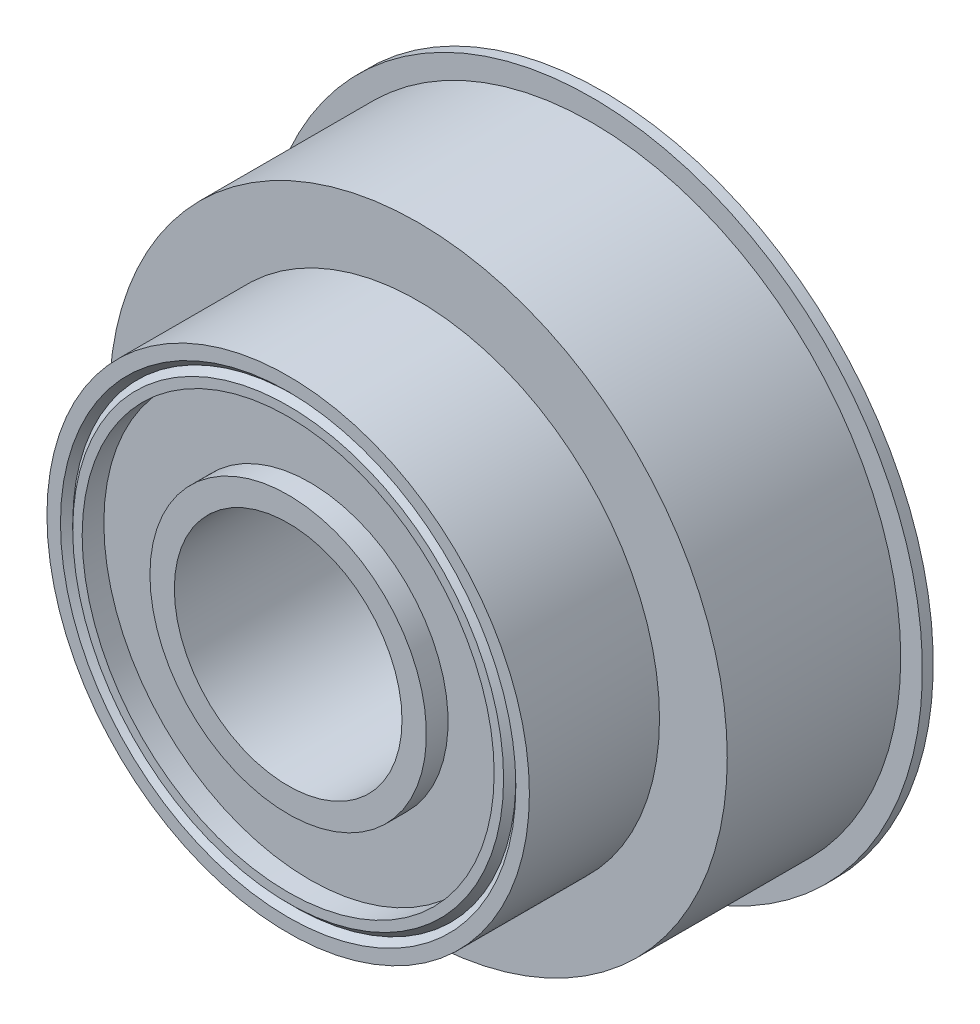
ISO-10303-21;
HEADER;
FILE_DESCRIPTION(('STEP AP214'),'2;1');
FILE_NAME('part.step','',(''),(''),'','','');
FILE_SCHEMA(('AUTOMOTIVE_DESIGN { 1 0 10303 214 1 1 1 1 }'));
ENDSEC;
DATA;
#1=APPLICATION_CONTEXT('core data for automotive mechanical design processes');
#2=APPLICATION_PROTOCOL_DEFINITION('international standard','automotive_design',2000,#1);
#3=PRODUCT_CONTEXT('',#1,'mechanical');
#4=PRODUCT('Part','Part','',(#3));
#5=PRODUCT_RELATED_PRODUCT_CATEGORY('part','',(#4));
#6=PRODUCT_DEFINITION_FORMATION('','',#4);
#7=PRODUCT_DEFINITION_CONTEXT('part definition',#1,'design');
#8=PRODUCT_DEFINITION('design','',#6,#7);
#9=PRODUCT_DEFINITION_SHAPE('','',#8);
#10=(LENGTH_UNIT() NAMED_UNIT(*) SI_UNIT(.MILLI.,.METRE.));
#11=(NAMED_UNIT(*) PLANE_ANGLE_UNIT() SI_UNIT($,.RADIAN.));
#12=(NAMED_UNIT(*) SI_UNIT($,.STERADIAN.) SOLID_ANGLE_UNIT());
#13=UNCERTAINTY_MEASURE_WITH_UNIT(LENGTH_MEASURE(1.E-05),#10,'distance_accuracy_value','');
#14=(GEOMETRIC_REPRESENTATION_CONTEXT(3) GLOBAL_UNCERTAINTY_ASSIGNED_CONTEXT((#13)) GLOBAL_UNIT_ASSIGNED_CONTEXT((#10,
#11,#12)) REPRESENTATION_CONTEXT('',''));
#15=CARTESIAN_POINT('',(0.,0.,0.));
#16=DIRECTION('',(0.,0.,1.));
#17=DIRECTION('',(1.,0.,0.));
#18=AXIS2_PLACEMENT_3D('',#15,#16,#17);
#19=CARTESIAN_POINT('',(0.,0.,-80.9));
#20=DIRECTION('',(0.,0.,-1.));
#21=DIRECTION('',(-1.,0.,0.));
#22=AXIS2_PLACEMENT_3D('',#19,#20,#21);
#23=CYLINDRICAL_SURFACE('',#22,10.5);
#24=CARTESIAN_POINT('',(0.,0.,-19.7706576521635));
#25=DIRECTION('',(0.,0.,-1.));
#26=DIRECTION('',(-1.,0.,0.));
#27=AXIS2_PLACEMENT_3D('',#24,#25,#26);
#28=CIRCLE('',#27,10.5);
#29=CARTESIAN_POINT('',(-10.5,0.,-19.7706576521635));
#30=VERTEX_POINT('',#29);
#31=EDGE_CURVE('E93',#30,#30,#28,.T.);
#32=ORIENTED_EDGE('',*,*,#31,.T.);
#33=EDGE_LOOP('',(#32));
#34=FACE_BOUND('',#33,.T.);
#35=CARTESIAN_POINT('',(0.,0.,0.));
#36=DIRECTION('',(0.,0.,-1.));
#37=DIRECTION('',(-1.,0.,0.));
#38=AXIS2_PLACEMENT_3D('',#35,#36,#37);
#39=CIRCLE('',#38,10.5);
#40=CARTESIAN_POINT('',(-10.5,0.,0.));
#41=VERTEX_POINT('',#40);
#42=EDGE_CURVE('E10',#41,#41,#39,.T.);
#43=ORIENTED_EDGE('',*,*,#42,.F.);
#44=EDGE_LOOP('',(#43));
#45=FACE_BOUND('',#44,.T.);
#46=ADVANCED_FACE('F29',(#34,#45),#23,.F.);
#47=CARTESIAN_POINT('',(0.,10.5,0.));
#48=DIRECTION('',(0.,0.,1.));
#49=DIRECTION('',(1.,0.,0.));
#50=AXIS2_PLACEMENT_3D('',#47,#48,#49);
#51=PLANE('',#50);
#52=ORIENTED_EDGE('',*,*,#42,.T.);
#53=EDGE_LOOP('',(#52));
#54=FACE_BOUND('',#53,.T.);
#55=CARTESIAN_POINT('',(0.,0.,0.));
#56=DIRECTION('',(0.,0.,-1.));
#57=DIRECTION('',(-1.,0.,0.));
#58=AXIS2_PLACEMENT_3D('',#55,#56,#57);
#59=CIRCLE('',#58,12.75);
#60=CARTESIAN_POINT('',(-12.75,0.,0.));
#61=VERTEX_POINT('',#60);
#62=EDGE_CURVE('E35',#61,#61,#59,.T.);
#63=ORIENTED_EDGE('',*,*,#62,.F.);
#64=EDGE_LOOP('',(#63));
#65=FACE_BOUND('',#64,.T.);
#66=ADVANCED_FACE('F111',(#54,#65),#51,.T.);
#67=CARTESIAN_POINT('',(0.,0.,-80.9));
#68=DIRECTION('',(0.,0.,-1.));
#69=DIRECTION('',(-1.,0.,0.));
#70=AXIS2_PLACEMENT_3D('',#67,#68,#69);
#71=CYLINDRICAL_SURFACE('',#70,12.75);
#72=ORIENTED_EDGE('',*,*,#62,.T.);
#73=EDGE_LOOP('',(#72));
#74=FACE_BOUND('',#73,.T.);
#75=CARTESIAN_POINT('',(0.,0.,-2.));
#76=DIRECTION('',(0.,0.,-1.));
#77=DIRECTION('',(-1.,0.,0.));
#78=AXIS2_PLACEMENT_3D('',#75,#76,#77);
#79=CIRCLE('',#78,12.75);
#80=CARTESIAN_POINT('',(-12.75,0.,-2.));
#81=VERTEX_POINT('',#80);
#82=EDGE_CURVE('E39',#81,#81,#79,.T.);
#83=ORIENTED_EDGE('',*,*,#82,.F.);
#84=EDGE_LOOP('',(#83));
#85=FACE_BOUND('',#84,.T.);
#86=ADVANCED_FACE('F115',(#74,#85),#71,.T.);
#87=CARTESIAN_POINT('',(0.,12.75,-2.));
#88=DIRECTION('',(0.,0.,1.));
#89=DIRECTION('',(1.,0.,0.));
#90=AXIS2_PLACEMENT_3D('',#87,#88,#89);
#91=PLANE('',#90);
#92=ORIENTED_EDGE('',*,*,#82,.T.);
#93=EDGE_LOOP('',(#92));
#94=FACE_BOUND('',#93,.T.);
#95=CARTESIAN_POINT('',(0.,0.,-2.));
#96=DIRECTION('',(0.,0.,-1.));
#97=DIRECTION('',(-1.,0.,0.));
#98=AXIS2_PLACEMENT_3D('',#95,#96,#97);
#99=CIRCLE('',#98,19.);
#100=CARTESIAN_POINT('',(-19.,0.,-2.));
#101=VERTEX_POINT('',#100);
#102=EDGE_CURVE('E43',#101,#101,#99,.T.);
#103=ORIENTED_EDGE('',*,*,#102,.F.);
#104=EDGE_LOOP('',(#103));
#105=FACE_BOUND('',#104,.T.);
#106=ADVANCED_FACE('F119',(#94,#105),#91,.T.);
#107=CARTESIAN_POINT('',(0.,0.,-80.9));
#108=DIRECTION('',(0.,0.,-1.));
#109=DIRECTION('',(-1.,0.,0.));
#110=AXIS2_PLACEMENT_3D('',#107,#108,#109);
#111=CYLINDRICAL_SURFACE('',#110,19.);
#112=ORIENTED_EDGE('',*,*,#102,.T.);
#113=EDGE_LOOP('',(#112));
#114=FACE_BOUND('',#113,.T.);
#115=CARTESIAN_POINT('',(0.,0.,0.));
#116=DIRECTION('',(0.,0.,-1.));
#117=DIRECTION('',(-1.,0.,0.));
#118=AXIS2_PLACEMENT_3D('',#115,#116,#117);
#119=CIRCLE('',#118,19.);
#120=CARTESIAN_POINT('',(-19.,0.,0.));
#121=VERTEX_POINT('',#120);
#122=EDGE_CURVE('E48',#121,#121,#119,.T.);
#123=ORIENTED_EDGE('',*,*,#122,.F.);
#124=EDGE_LOOP('',(#123));
#125=FACE_BOUND('',#124,.T.);
#126=ADVANCED_FACE('F125',(#114,#125),#111,.F.);
#127=CARTESIAN_POINT('',(0.,19.,0.));
#128=DIRECTION('',(0.,0.,1.));
#129=DIRECTION('',(1.,0.,0.));
#130=AXIS2_PLACEMENT_3D('',#127,#128,#129);
#131=PLANE('',#130);
#132=ORIENTED_EDGE('',*,*,#122,.T.);
#133=EDGE_LOOP('',(#132));
#134=FACE_BOUND('',#133,.T.);
#135=CARTESIAN_POINT('',(0.,0.,0.));
#136=DIRECTION('',(0.,0.,-1.));
#137=DIRECTION('',(-1.,0.,0.));
#138=AXIS2_PLACEMENT_3D('',#135,#136,#137);
#139=CIRCLE('',#138,19.8699370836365);
#140=CARTESIAN_POINT('',(-19.8699370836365,0.,0.));
#141=VERTEX_POINT('',#140);
#142=EDGE_CURVE('E51',#141,#141,#139,.T.);
#143=ORIENTED_EDGE('',*,*,#142,.F.);
#144=EDGE_LOOP('',(#143));
#145=FACE_BOUND('',#144,.T.);
#146=ADVANCED_FACE('F129',(#134,#145),#131,.T.);
#147=CARTESIAN_POINT('',(0.,0.,-0.56503145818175));
#148=DIRECTION('',(0.,0.,-1.));
#149=DIRECTION('',(-1.,0.,0.));
#150=AXIS2_PLACEMENT_3D('',#147,#148,#149);
#151=CONICAL_SURFACE('',#150,20.4349685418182,0.785398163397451);
#152=ORIENTED_EDGE('',*,*,#142,.T.);
#153=EDGE_LOOP('',(#152));
#154=FACE_BOUND('',#153,.T.);
#155=CARTESIAN_POINT('',(0.,0.,-0.56503145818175));
#156=DIRECTION('',(0.,0.,-1.));
#157=DIRECTION('',(-1.,0.,0.));
#158=AXIS2_PLACEMENT_3D('',#155,#156,#157);
#159=CIRCLE('',#158,20.4349685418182);
#160=CARTESIAN_POINT('',(-20.4349685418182,0.,-0.56503145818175));
#161=VERTEX_POINT('',#160);
#162=EDGE_CURVE('E54',#161,#161,#159,.T.);
#163=ORIENTED_EDGE('',*,*,#162,.F.);
#164=EDGE_LOOP('',(#163));
#165=FACE_BOUND('',#164,.T.);
#166=ADVANCED_FACE('F133',(#154,#165),#151,.T.);
#167=CARTESIAN_POINT('',(0.,0.,0.));
#168=DIRECTION('',(0.,0.,1.));
#169=DIRECTION('',(1.,0.,0.));
#170=AXIS2_PLACEMENT_3D('',#167,#168,#169);
#171=CONICAL_SURFACE('',#170,21.,0.785398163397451);
#172=ORIENTED_EDGE('',*,*,#162,.T.);
#173=EDGE_LOOP('',(#172));
#174=FACE_BOUND('',#173,.T.);
#175=CARTESIAN_POINT('',(0.,0.,0.));
#176=DIRECTION('',(0.,0.,-1.));
#177=DIRECTION('',(-1.,0.,0.));
#178=AXIS2_PLACEMENT_3D('',#175,#176,#177);
#179=CIRCLE('',#178,21.);
#180=CARTESIAN_POINT('',(-21.,0.,0.));
#181=VERTEX_POINT('',#180);
#182=EDGE_CURVE('E57',#181,#181,#179,.T.);
#183=ORIENTED_EDGE('',*,*,#182,.F.);
#184=EDGE_LOOP('',(#183));
#185=FACE_BOUND('',#184,.T.);
#186=ADVANCED_FACE('F137',(#174,#185),#171,.F.);
#187=CARTESIAN_POINT('',(0.,21.,0.));
#188=DIRECTION('',(0.,0.,1.));
#189=DIRECTION('',(1.,0.,0.));
#190=AXIS2_PLACEMENT_3D('',#187,#188,#189);
#191=PLANE('',#190);
#192=ORIENTED_EDGE('',*,*,#182,.T.);
#193=EDGE_LOOP('',(#192));
#194=FACE_BOUND('',#193,.T.);
#195=CARTESIAN_POINT('',(0.,0.,0.));
#196=DIRECTION('',(0.,0.,-1.));
#197=DIRECTION('',(-1.,0.,0.));
#198=AXIS2_PLACEMENT_3D('',#195,#196,#197);
#199=CIRCLE('',#198,22.25);
#200=CARTESIAN_POINT('',(-22.25,0.,0.));
#201=VERTEX_POINT('',#200);
#202=EDGE_CURVE('E60',#201,#201,#199,.T.);
#203=ORIENTED_EDGE('',*,*,#202,.F.);
#204=EDGE_LOOP('',(#203));
#205=FACE_BOUND('',#204,.T.);
#206=ADVANCED_FACE('F141',(#194,#205),#191,.T.);
#207=CARTESIAN_POINT('',(0.,0.,-80.9));
#208=DIRECTION('',(0.,0.,-1.));
#209=DIRECTION('',(-1.,0.,0.));
#210=AXIS2_PLACEMENT_3D('',#207,#208,#209);
#211=CYLINDRICAL_SURFACE('',#210,22.25);
#212=ORIENTED_EDGE('',*,*,#202,.T.);
#213=EDGE_LOOP('',(#212));
#214=FACE_BOUND('',#213,.T.);
#215=CARTESIAN_POINT('',(0.,0.,-12.));
#216=DIRECTION('',(0.,0.,-1.));
#217=DIRECTION('',(-1.,0.,0.));
#218=AXIS2_PLACEMENT_3D('',#215,#216,#217);
#219=CIRCLE('',#218,22.25);
#220=CARTESIAN_POINT('',(-22.25,0.,-12.));
#221=VERTEX_POINT('',#220);
#222=EDGE_CURVE('E63',#221,#221,#219,.T.);
#223=ORIENTED_EDGE('',*,*,#222,.F.);
#224=EDGE_LOOP('',(#223));
#225=FACE_BOUND('',#224,.T.);
#226=ADVANCED_FACE('F145',(#214,#225),#211,.T.);
#227=CARTESIAN_POINT('',(0.,22.25,-12.));
#228=DIRECTION('',(0.,0.,1.));
#229=DIRECTION('',(1.,0.,0.));
#230=AXIS2_PLACEMENT_3D('',#227,#228,#229);
#231=PLANE('',#230);
#232=ORIENTED_EDGE('',*,*,#222,.T.);
#233=EDGE_LOOP('',(#232));
#234=FACE_BOUND('',#233,.T.);
#235=CARTESIAN_POINT('',(0.,0.,-12.));
#236=DIRECTION('',(0.,0.,-1.));
#237=DIRECTION('',(-1.,0.,0.));
#238=AXIS2_PLACEMENT_3D('',#235,#236,#237);
#239=CIRCLE('',#238,28.5);
#240=CARTESIAN_POINT('',(-28.5,0.,-12.));
#241=VERTEX_POINT('',#240);
#242=EDGE_CURVE('E66',#241,#241,#239,.T.);
#243=ORIENTED_EDGE('',*,*,#242,.F.);
#244=EDGE_LOOP('',(#243));
#245=FACE_BOUND('',#244,.T.);
#246=ADVANCED_FACE('F149',(#234,#245),#231,.T.);
#247=CARTESIAN_POINT('',(0.,0.,-80.9));
#248=DIRECTION('',(0.,0.,-1.));
#249=DIRECTION('',(-1.,0.,0.));
#250=AXIS2_PLACEMENT_3D('',#247,#248,#249);
#251=CYLINDRICAL_SURFACE('',#250,28.5);
#252=ORIENTED_EDGE('',*,*,#242,.T.);
#253=EDGE_LOOP('',(#252));
#254=FACE_BOUND('',#253,.T.);
#255=CARTESIAN_POINT('',(0.,0.,-28.));
#256=DIRECTION('',(0.,0.,-1.));
#257=DIRECTION('',(-1.,0.,0.));
#258=AXIS2_PLACEMENT_3D('',#255,#256,#257);
#259=CIRCLE('',#258,28.5);
#260=CARTESIAN_POINT('',(-28.5,0.,-28.));
#261=VERTEX_POINT('',#260);
#262=EDGE_CURVE('E69',#261,#261,#259,.T.);
#263=ORIENTED_EDGE('',*,*,#262,.F.);
#264=EDGE_LOOP('',(#263));
#265=FACE_BOUND('',#264,.T.);
#266=ADVANCED_FACE('F153',(#254,#265),#251,.T.);
#267=CARTESIAN_POINT('',(0.,28.5,-28.));
#268=DIRECTION('',(0.,0.,1.));
#269=DIRECTION('',(1.,0.,0.));
#270=AXIS2_PLACEMENT_3D('',#267,#268,#269);
#271=PLANE('',#270);
#272=ORIENTED_EDGE('',*,*,#262,.T.);
#273=EDGE_LOOP('',(#272));
#274=FACE_BOUND('',#273,.T.);
#275=CARTESIAN_POINT('',(0.,0.,-28.));
#276=DIRECTION('',(0.,0.,-1.));
#277=DIRECTION('',(-1.,0.,0.));
#278=AXIS2_PLACEMENT_3D('',#275,#276,#277);
#279=CIRCLE('',#278,30.5);
#280=CARTESIAN_POINT('',(-30.5,0.,-28.));
#281=VERTEX_POINT('',#280);
#282=EDGE_CURVE('E72',#281,#281,#279,.T.);
#283=ORIENTED_EDGE('',*,*,#282,.F.);
#284=EDGE_LOOP('',(#283));
#285=FACE_BOUND('',#284,.T.);
#286=ADVANCED_FACE('F157',(#274,#285),#271,.T.);
#287=CARTESIAN_POINT('',(0.,0.,-80.9));
#288=DIRECTION('',(0.,0.,-1.));
#289=DIRECTION('',(-1.,0.,0.));
#290=AXIS2_PLACEMENT_3D('',#287,#288,#289);
#291=CYLINDRICAL_SURFACE('',#290,30.5);
#292=ORIENTED_EDGE('',*,*,#282,.T.);
#293=EDGE_LOOP('',(#292));
#294=FACE_BOUND('',#293,.T.);
#295=CARTESIAN_POINT('',(0.,0.,-29.));
#296=DIRECTION('',(0.,0.,-1.));
#297=DIRECTION('',(-1.,0.,0.));
#298=AXIS2_PLACEMENT_3D('',#295,#296,#297);
#299=CIRCLE('',#298,30.5);
#300=CARTESIAN_POINT('',(-30.5,0.,-29.));
#301=VERTEX_POINT('',#300);
#302=EDGE_CURVE('E75',#301,#301,#299,.T.);
#303=ORIENTED_EDGE('',*,*,#302,.F.);
#304=EDGE_LOOP('',(#303));
#305=FACE_BOUND('',#304,.T.);
#306=ADVANCED_FACE('F161',(#294,#305),#291,.T.);
#307=CARTESIAN_POINT('',(0.,30.5,-29.));
#308=DIRECTION('',(0.,0.,-1.));
#309=DIRECTION('',(-1.,0.,0.));
#310=AXIS2_PLACEMENT_3D('',#307,#308,#309);
#311=PLANE('',#310);
#312=ORIENTED_EDGE('',*,*,#302,.T.);
#313=EDGE_LOOP('',(#312));
#314=FACE_BOUND('',#313,.T.);
#315=CARTESIAN_POINT('',(0.,0.,-29.));
#316=DIRECTION('',(0.,0.,-1.));
#317=DIRECTION('',(-1.,0.,0.));
#318=AXIS2_PLACEMENT_3D('',#315,#316,#317);
#319=CIRCLE('',#318,26.5);
#320=CARTESIAN_POINT('',(-26.5,0.,-29.));
#321=VERTEX_POINT('',#320);
#322=EDGE_CURVE('E78',#321,#321,#319,.T.);
#323=ORIENTED_EDGE('',*,*,#322,.F.);
#324=EDGE_LOOP('',(#323));
#325=FACE_BOUND('',#324,.T.);
#326=ADVANCED_FACE('F165',(#314,#325),#311,.T.);
#327=CARTESIAN_POINT('',(0.,0.,-80.9));
#328=DIRECTION('',(0.,0.,-1.));
#329=DIRECTION('',(-1.,0.,0.));
#330=AXIS2_PLACEMENT_3D('',#327,#328,#329);
#331=CYLINDRICAL_SURFACE('',#330,26.5);
#332=ORIENTED_EDGE('',*,*,#322,.T.);
#333=EDGE_LOOP('',(#332));
#334=FACE_BOUND('',#333,.T.);
#335=CARTESIAN_POINT('',(0.,0.,-28.5));
#336=DIRECTION('',(0.,0.,-1.));
#337=DIRECTION('',(-1.,0.,0.));
#338=AXIS2_PLACEMENT_3D('',#335,#336,#337);
#339=CIRCLE('',#338,26.5);
#340=CARTESIAN_POINT('',(-26.5,0.,-28.5));
#341=VERTEX_POINT('',#340);
#342=EDGE_CURVE('E81',#341,#341,#339,.T.);
#343=ORIENTED_EDGE('',*,*,#342,.F.);
#344=EDGE_LOOP('',(#343));
#345=FACE_BOUND('',#344,.T.);
#346=ADVANCED_FACE('F169',(#334,#345),#331,.F.);
#347=CARTESIAN_POINT('',(0.,26.5,-28.5));
#348=DIRECTION('',(0.,0.,-1.));
#349=DIRECTION('',(-1.,0.,0.));
#350=AXIS2_PLACEMENT_3D('',#347,#348,#349);
#351=PLANE('',#350);
#352=ORIENTED_EDGE('',*,*,#342,.T.);
#353=EDGE_LOOP('',(#352));
#354=FACE_BOUND('',#353,.T.);
#355=CARTESIAN_POINT('',(0.,0.,-28.5));
#356=DIRECTION('',(0.,0.,-1.));
#357=DIRECTION('',(-1.,0.,0.));
#358=AXIS2_PLACEMENT_3D('',#355,#356,#357);
#359=CIRCLE('',#358,17.5);
#360=CARTESIAN_POINT('',(-17.5,0.,-28.5));
#361=VERTEX_POINT('',#360);
#362=EDGE_CURVE('E84',#361,#361,#359,.T.);
#363=ORIENTED_EDGE('',*,*,#362,.F.);
#364=EDGE_LOOP('',(#363));
#365=FACE_BOUND('',#364,.T.);
#366=ADVANCED_FACE('F173',(#354,#365),#351,.T.);
#367=CARTESIAN_POINT('',(0.,0.,-80.9));
#368=DIRECTION('',(0.,0.,-1.));
#369=DIRECTION('',(-1.,0.,0.));
#370=AXIS2_PLACEMENT_3D('',#367,#368,#369);
#371=CYLINDRICAL_SURFACE('',#370,17.5);
#372=ORIENTED_EDGE('',*,*,#362,.T.);
#373=EDGE_LOOP('',(#372));
#374=FACE_BOUND('',#373,.T.);
#375=CARTESIAN_POINT('',(0.,0.,-22.2706576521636));
#376=DIRECTION('',(0.,0.,-1.));
#377=DIRECTION('',(-1.,0.,0.));
#378=AXIS2_PLACEMENT_3D('',#375,#376,#377);
#379=CIRCLE('',#378,17.5);
#380=CARTESIAN_POINT('',(-17.5,0.,-22.2706576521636));
#381=VERTEX_POINT('',#380);
#382=EDGE_CURVE('E87',#381,#381,#379,.T.);
#383=ORIENTED_EDGE('',*,*,#382,.F.);
#384=EDGE_LOOP('',(#383));
#385=FACE_BOUND('',#384,.T.);
#386=ADVANCED_FACE('F107',(#374,#385),#371,.F.);
#387=CARTESIAN_POINT('',(0.,0.,-19.7706576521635));
#388=DIRECTION('',(0.,0.,-1.));
#389=DIRECTION('',(-1.,0.,0.));
#390=AXIS2_PLACEMENT_3D('',#387,#388,#389);
#391=CONICAL_SURFACE('',#390,15.,0.785398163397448);
#392=ORIENTED_EDGE('',*,*,#382,.T.);
#393=EDGE_LOOP('',(#392));
#394=FACE_BOUND('',#393,.T.);
#395=CARTESIAN_POINT('',(0.,0.,-19.7706576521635));
#396=DIRECTION('',(0.,0.,-1.));
#397=DIRECTION('',(-1.,0.,0.));
#398=AXIS2_PLACEMENT_3D('',#395,#396,#397);
#399=CIRCLE('',#398,15.);
#400=CARTESIAN_POINT('',(-15.,0.,-19.7706576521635));
#401=VERTEX_POINT('',#400);
#402=EDGE_CURVE('E90',#401,#401,#399,.T.);
#403=ORIENTED_EDGE('',*,*,#402,.F.);
#404=EDGE_LOOP('',(#403));
#405=FACE_BOUND('',#404,.T.);
#406=ADVANCED_FACE('F101',(#394,#405),#391,.F.);
#407=CARTESIAN_POINT('',(0.,15.,-19.7706576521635));
#408=DIRECTION('',(0.,0.,-1.));
#409=DIRECTION('',(-1.,0.,0.));
#410=AXIS2_PLACEMENT_3D('',#407,#408,#409);
#411=PLANE('',#410);
#412=ORIENTED_EDGE('',*,*,#402,.T.);
#413=EDGE_LOOP('',(#412));
#414=FACE_BOUND('',#413,.T.);
#415=ORIENTED_EDGE('',*,*,#31,.F.);
#416=EDGE_LOOP('',(#415));
#417=FACE_BOUND('',#416,.T.);
#418=ADVANCED_FACE('F99',(#414,#417),#411,.T.);
#419=CLOSED_SHELL('',(#46,#66,#86,#106,#126,#146,#166,#186,#206,#226,#246,#266,#286,#306,#326,
#346,#366,#386,#406,#418));
#420=MANIFOLD_SOLID_BREP('B2',#419);
#421=ADVANCED_BREP_SHAPE_REPRESENTATION('',(#18,#420),#14);
#422=SHAPE_DEFINITION_REPRESENTATION(#9,#421);
ENDSEC;
END-ISO-10303-21;
